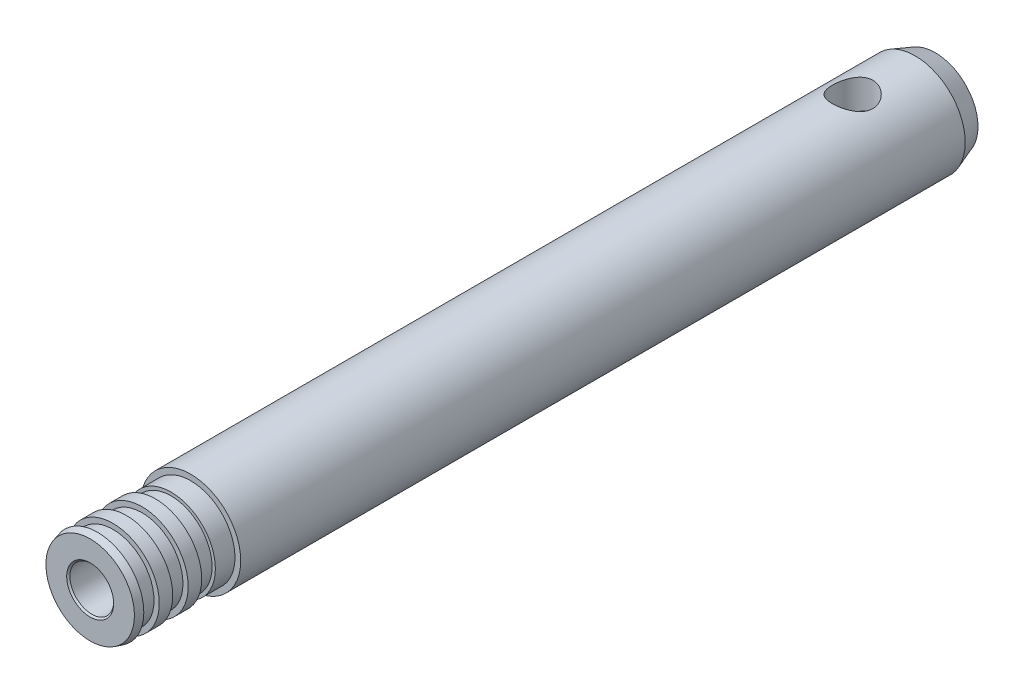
from build123d import *

# Parameters (mm, degrees)
SKETCH1_R                  = 3.9497
SKETCH1_R_2                = 1.7272
SHANKLENGTH_DEPTH          = 58.801
CHAMFER1_SIZE              = 1.5875
CHAMFER1_SIZE2             = 0.577802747
CHAMFER2_SIZE              = 0.127
EXTRUDE1_DEPTH             = 60.065707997
EXTRUDE1_DEPTH_BACK        = 60.065707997
SKETCH_BALLTRACKDIAMETER_R = 1.6
SKETCH9_R                  = 3.65125
SKETCH9_R_2                = 1.7272
EXTRUDE2_DEPTH             = 7.9375
SKETCH12_W                 = 1.5494
SKETCH12_H                 = 0.1524
SKETCH13_W                 = 1.2192
SKETCH13_H                 = 0.41275
SKETCH13_W_2               = 1.2319
CHAMFER3_SIZE              = 0.127


with BuildPart() as part:
    # Sketch1 → ShankLength (new body)
    with BuildSketch(Plane.XY):
        with Locations(Location((0, 0, 0), (0, 0, 180))):
            Circle(SKETCH1_R)
        with Locations(Location((0, 0, 0), (0, 0, 180))):
            Circle(SKETCH1_R_2, mode=Mode.SUBTRACT)
    extrude(amount=SHANKLENGTH_DEPTH)

    # Chamfer1
    chamfer1_edges = [part.edges().sort_by_distance(p)[0] for p in [
        (3.9497, 0, 0),
    ]]
    chamfer1_side = [part.faces().sort_by_distance(p)[0] for p in [
        (3.9497, 0, 29.4005),
    ]]
    chamfer(chamfer1_edges, length=CHAMFER1_SIZE, length2=CHAMFER1_SIZE2, reference=chamfer1_side[0])

    # Chamfer2
    chamfer2_edges = [part.edges().sort_by_distance(p)[0] for p in [
        (1.7272, 0, 0),
    ]]
    chamfer(chamfer2_edges, length=CHAMFER2_SIZE)

    # Sketch-BallTrackDiameter → Extrude1 (cut, two sides: drawn at the far end of the back side and taken through both)
    with BuildSketch(Plane(origin=(0, 0, 0), x_dir=(1, 0, 0), z_dir=(0, 1, 0)).offset(-EXTRUDE1_DEPTH_BACK)):
        with Locations(Location((0, -6.528, 0), (0, 0, 270))):
            Circle(SKETCH_BALLTRACKDIAMETER_R)
    extrude(amount=EXTRUDE1_DEPTH + EXTRUDE1_DEPTH_BACK, mode=Mode.SUBTRACT)

    # Sketch9 → Extrude2 (add)
    with BuildSketch(Plane.XY.offset(58.801)):
        Circle(SKETCH9_R)
        Circle(SKETCH9_R_2, mode=Mode.SUBTRACT)
    extrude(amount=EXTRUDE2_DEPTH)

    # Sketch12 → Cut-Revolve2 (revolve, cut)
    with BuildSketch(Plane(origin=(0, 0, 0), x_dir=(0, 0, -1), z_dir=(1, 0, 0)), mode=Mode.PRIVATE) as cut_revolve2_sk:
        with Locations((-59.5757, 3.57505)):
            Rectangle(SKETCH12_W, SKETCH12_H)
    revolve(cut_revolve2_sk.sketch.rotate(Axis((0, 0, 58.801), (0, 0, -1)), 90), axis=Axis((0, 0, 58.801), (0, 0, -1)), mode=Mode.SUBTRACT)

    # Sketch13 → Cut-Revolve3 (revolve, cut)
    with BuildSketch(Plane(origin=(0, 0, 0), x_dir=(0, 0, -1), z_dir=(1, 0, 0)), mode=Mode.PRIVATE) as cut_revolve3_sk:
        with Locations((-63.2587, 3.444875)):
            Rectangle(SKETCH13_W, SKETCH13_H)
        with Locations((-65.5447, 3.444875)):
            Rectangle(SKETCH13_W, SKETCH13_H)
        with Locations((-60.96635, 3.444875)):
            Rectangle(SKETCH13_W_2, SKETCH13_H)
    revolve(cut_revolve3_sk.sketch.rotate(Axis((0, 0, 66.7385), (0, 0, -1)), 90), axis=Axis((0, 0, 66.7385), (0, 0, -1)), mode=Mode.SUBTRACT)

    # Chamfer3
    chamfer3_edges = [part.edges().sort_by_distance(p)[0] for p in [
        (-1.7272, 0, 66.7385),
    ]]
    chamfer(chamfer3_edges, length=CHAMFER3_SIZE)

    # Sketch15 → Cut-Revolve5 (revolve, cut)
    with BuildSketch(Plane(origin=(0, 0, 0), x_dir=(0, 0, -1), z_dir=(1, 0, 0)), mode=Mode.PRIVATE) as cut_revolve5_sk:
        Polygon((-66.1543, 3.65125), (-66.7385, 3.65125), (-66.7385, 3.494714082), align=None)
    revolve(cut_revolve5_sk.sketch.rotate(Axis((0, 0, 66.7385), (0, 0, -1)), 90), axis=Axis((0, 0, 66.7385), (0, 0, -1)), mode=Mode.SUBTRACT)


solid = part.part
